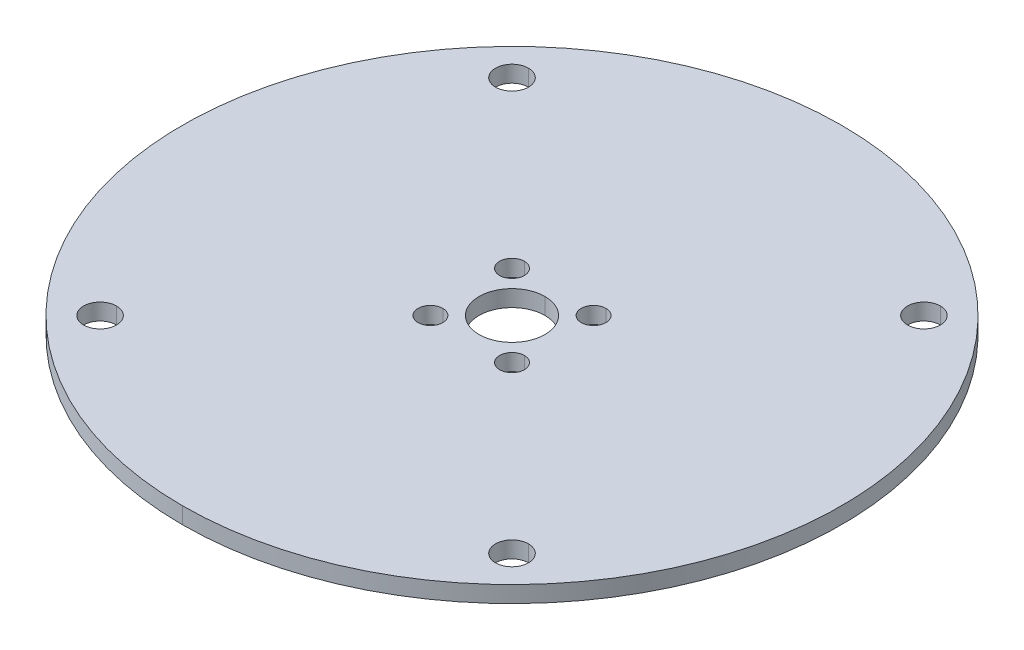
ISO-10303-21;
HEADER;
FILE_DESCRIPTION(('STEP AP214'),'2;1');
FILE_NAME('part.step','',(''),(''),'','','');
FILE_SCHEMA(('AUTOMOTIVE_DESIGN { 1 0 10303 214 1 1 1 1 }'));
ENDSEC;
DATA;
#1=APPLICATION_CONTEXT('core data for automotive mechanical design processes');
#2=APPLICATION_PROTOCOL_DEFINITION('international standard','automotive_design',2000,#1);
#3=PRODUCT_CONTEXT('',#1,'mechanical');
#4=PRODUCT('Part','Part','',(#3));
#5=PRODUCT_RELATED_PRODUCT_CATEGORY('part','',(#4));
#6=PRODUCT_DEFINITION_FORMATION('','',#4);
#7=PRODUCT_DEFINITION_CONTEXT('part definition',#1,'design');
#8=PRODUCT_DEFINITION('design','',#6,#7);
#9=PRODUCT_DEFINITION_SHAPE('','',#8);
#10=(LENGTH_UNIT() NAMED_UNIT(*) SI_UNIT(.MILLI.,.METRE.));
#11=(NAMED_UNIT(*) PLANE_ANGLE_UNIT() SI_UNIT($,.RADIAN.));
#12=(NAMED_UNIT(*) SI_UNIT($,.STERADIAN.) SOLID_ANGLE_UNIT());
#13=UNCERTAINTY_MEASURE_WITH_UNIT(LENGTH_MEASURE(1.E-05),#10,'distance_accuracy_value','');
#14=(GEOMETRIC_REPRESENTATION_CONTEXT(3) GLOBAL_UNCERTAINTY_ASSIGNED_CONTEXT((#13)) GLOBAL_UNIT_ASSIGNED_CONTEXT((#10,
#11,#12)) REPRESENTATION_CONTEXT('',''));
#15=CARTESIAN_POINT('',(0.,0.,0.));
#16=DIRECTION('',(0.,0.,1.));
#17=DIRECTION('',(1.,0.,0.));
#18=AXIS2_PLACEMENT_3D('',#15,#16,#17);
#19=CARTESIAN_POINT('',(273.9989878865,-2.,-129.7363133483));
#20=DIRECTION('',(0.,1.,0.));
#21=DIRECTION('',(0.,0.,1.));
#22=AXIS2_PLACEMENT_3D('',#19,#20,#21);
#23=CYLINDRICAL_SURFACE('',#22,2.);
#24=DIRECTION('',(0.,-1.,0.));
#25=VECTOR('',#24,1.);
#26=CARTESIAN_POINT('',(273.9989878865,0.,-131.7363133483));
#27=LINE('',#26,#25);
#28=CARTESIAN_POINT('',(273.9989878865,0.,-131.7363133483));
#29=VERTEX_POINT('',#28);
#30=CARTESIAN_POINT('',(273.9989878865,-2.,-131.7363133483));
#31=VERTEX_POINT('',#30);
#32=EDGE_CURVE('E11',#29,#31,#27,.T.);
#33=ORIENTED_EDGE('',*,*,#32,.F.);
#34=CARTESIAN_POINT('',(273.9989878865,0.,-129.7363133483));
#35=DIRECTION('',(0.,-1.,0.));
#36=DIRECTION('',(0.,0.,1.));
#37=AXIS2_PLACEMENT_3D('',#34,#35,#36);
#38=CIRCLE('',#37,2.);
#39=CARTESIAN_POINT('',(273.9989878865,0.,-127.7363133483));
#40=VERTEX_POINT('',#39);
#41=EDGE_CURVE('E228',#40,#29,#38,.T.);
#42=ORIENTED_EDGE('',*,*,#41,.F.);
#43=DIRECTION('',(0.,-1.,0.));
#44=VECTOR('',#43,1.);
#45=CARTESIAN_POINT('',(273.9989878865,0.,-127.7363133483));
#46=LINE('',#45,#44);
#47=CARTESIAN_POINT('',(273.9989878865,-2.,-127.7363133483));
#48=VERTEX_POINT('',#47);
#49=EDGE_CURVE('E28',#40,#48,#46,.T.);
#50=ORIENTED_EDGE('',*,*,#49,.T.);
#51=CARTESIAN_POINT('',(273.9989878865,-2.,-129.7363133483));
#52=DIRECTION('',(0.,1.,0.));
#53=DIRECTION('',(0.,0.,-1.));
#54=AXIS2_PLACEMENT_3D('',#51,#52,#53);
#55=CIRCLE('',#54,2.);
#56=EDGE_CURVE('E216',#31,#48,#55,.T.);
#57=ORIENTED_EDGE('',*,*,#56,.F.);
#58=EDGE_LOOP('',(#33,#42,#50,#57));
#59=FACE_BOUND('',#58,.T.);
#60=ADVANCED_FACE('F17',(#59),#23,.F.);
#61=CARTESIAN_POINT('',(273.9989878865,-2.,-129.7363133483));
#62=DIRECTION('',(0.,1.,0.));
#63=DIRECTION('',(0.,0.,1.));
#64=AXIS2_PLACEMENT_3D('',#61,#62,#63);
#65=CYLINDRICAL_SURFACE('',#64,2.);
#66=CARTESIAN_POINT('',(273.9989878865,-2.,-129.7363133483));
#67=DIRECTION('',(0.,1.,0.));
#68=DIRECTION('',(0.,0.,1.));
#69=AXIS2_PLACEMENT_3D('',#66,#67,#68);
#70=CIRCLE('',#69,2.);
#71=EDGE_CURVE('E209',#48,#31,#70,.T.);
#72=ORIENTED_EDGE('',*,*,#71,.F.);
#73=ORIENTED_EDGE('',*,*,#49,.F.);
#74=CARTESIAN_POINT('',(273.9989878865,0.,-129.7363133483));
#75=DIRECTION('',(0.,-1.,0.));
#76=DIRECTION('',(0.,0.,-1.));
#77=AXIS2_PLACEMENT_3D('',#74,#75,#76);
#78=CIRCLE('',#77,2.);
#79=EDGE_CURVE('E283',#29,#40,#78,.T.);
#80=ORIENTED_EDGE('',*,*,#79,.F.);
#81=ORIENTED_EDGE('',*,*,#32,.T.);
#82=EDGE_LOOP('',(#72,#73,#80,#81));
#83=FACE_BOUND('',#82,.T.);
#84=ADVANCED_FACE('F485',(#83),#65,.F.);
#85=CARTESIAN_POINT('',(273.9989878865,-2.,-179.7363133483));
#86=DIRECTION('',(0.,1.,0.));
#87=DIRECTION('',(0.,0.,1.));
#88=AXIS2_PLACEMENT_3D('',#85,#86,#87);
#89=CYLINDRICAL_SURFACE('',#88,2.);
#90=DIRECTION('',(0.,-1.,0.));
#91=VECTOR('',#90,1.);
#92=CARTESIAN_POINT('',(273.9989878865,0.,-181.7363133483));
#93=LINE('',#92,#91);
#94=CARTESIAN_POINT('',(273.9989878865,0.,-181.7363133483));
#95=VERTEX_POINT('',#94);
#96=CARTESIAN_POINT('',(273.9989878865,-2.,-181.7363133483));
#97=VERTEX_POINT('',#96);
#98=EDGE_CURVE('E229',#95,#97,#93,.T.);
#99=ORIENTED_EDGE('',*,*,#98,.F.);
#100=CARTESIAN_POINT('',(273.9989878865,0.,-179.7363133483));
#101=DIRECTION('',(0.,-1.,0.));
#102=DIRECTION('',(0.,0.,1.));
#103=AXIS2_PLACEMENT_3D('',#100,#101,#102);
#104=CIRCLE('',#103,2.);
#105=CARTESIAN_POINT('',(273.9989878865,0.,-177.7363133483));
#106=VERTEX_POINT('',#105);
#107=EDGE_CURVE('E220',#106,#95,#104,.T.);
#108=ORIENTED_EDGE('',*,*,#107,.F.);
#109=DIRECTION('',(0.,-1.,0.));
#110=VECTOR('',#109,1.);
#111=CARTESIAN_POINT('',(273.9989878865,0.,-177.7363133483));
#112=LINE('',#111,#110);
#113=CARTESIAN_POINT('',(273.9989878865,-2.,-177.7363133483));
#114=VERTEX_POINT('',#113);
#115=EDGE_CURVE('E21',#106,#114,#112,.T.);
#116=ORIENTED_EDGE('',*,*,#115,.T.);
#117=CARTESIAN_POINT('',(273.9989878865,-2.,-179.7363133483));
#118=DIRECTION('',(0.,1.,0.));
#119=DIRECTION('',(0.,0.,-1.));
#120=AXIS2_PLACEMENT_3D('',#117,#118,#119);
#121=CIRCLE('',#120,2.);
#122=EDGE_CURVE('E340',#97,#114,#121,.T.);
#123=ORIENTED_EDGE('',*,*,#122,.F.);
#124=EDGE_LOOP('',(#99,#108,#116,#123));
#125=FACE_BOUND('',#124,.T.);
#126=ADVANCED_FACE('F490',(#125),#89,.F.);
#127=CARTESIAN_POINT('',(273.9989878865,-2.,-179.7363133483));
#128=DIRECTION('',(0.,1.,0.));
#129=DIRECTION('',(0.,0.,1.));
#130=AXIS2_PLACEMENT_3D('',#127,#128,#129);
#131=CYLINDRICAL_SURFACE('',#130,2.);
#132=CARTESIAN_POINT('',(273.9989878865,-2.,-179.7363133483));
#133=DIRECTION('',(0.,1.,0.));
#134=DIRECTION('',(0.,0.,1.));
#135=AXIS2_PLACEMENT_3D('',#132,#133,#134);
#136=CIRCLE('',#135,2.);
#137=EDGE_CURVE('E263',#114,#97,#136,.T.);
#138=ORIENTED_EDGE('',*,*,#137,.F.);
#139=ORIENTED_EDGE('',*,*,#115,.F.);
#140=CARTESIAN_POINT('',(273.9989878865,0.,-179.7363133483));
#141=DIRECTION('',(0.,-1.,0.));
#142=DIRECTION('',(0.,0.,-1.));
#143=AXIS2_PLACEMENT_3D('',#140,#141,#142);
#144=CIRCLE('',#143,2.);
#145=EDGE_CURVE('E223',#95,#106,#144,.T.);
#146=ORIENTED_EDGE('',*,*,#145,.F.);
#147=ORIENTED_EDGE('',*,*,#98,.T.);
#148=EDGE_LOOP('',(#138,#139,#146,#147));
#149=FACE_BOUND('',#148,.T.);
#150=ADVANCED_FACE('F502',(#149),#131,.F.);
#151=CARTESIAN_POINT('',(223.9989878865,-2.,-179.7363133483));
#152=DIRECTION('',(0.,1.,0.));
#153=DIRECTION('',(0.,0.,1.));
#154=AXIS2_PLACEMENT_3D('',#151,#152,#153);
#155=CYLINDRICAL_SURFACE('',#154,2.);
#156=DIRECTION('',(0.,-1.,0.));
#157=VECTOR('',#156,1.);
#158=CARTESIAN_POINT('',(223.9989878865,0.,-181.7363133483));
#159=LINE('',#158,#157);
#160=CARTESIAN_POINT('',(223.9989878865,0.,-181.7363133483));
#161=VERTEX_POINT('',#160);
#162=CARTESIAN_POINT('',(223.9989878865,-2.,-181.7363133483));
#163=VERTEX_POINT('',#162);
#164=EDGE_CURVE('E376',#161,#163,#159,.T.);
#165=ORIENTED_EDGE('',*,*,#164,.F.);
#166=CARTESIAN_POINT('',(223.9989878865,0.,-179.7363133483));
#167=DIRECTION('',(0.,-1.,0.));
#168=DIRECTION('',(0.,0.,1.));
#169=AXIS2_PLACEMENT_3D('',#166,#167,#168);
#170=CIRCLE('',#169,2.);
#171=CARTESIAN_POINT('',(223.9989878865,0.,-177.7363133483));
#172=VERTEX_POINT('',#171);
#173=EDGE_CURVE('E360',#172,#161,#170,.T.);
#174=ORIENTED_EDGE('',*,*,#173,.F.);
#175=DIRECTION('',(0.,-1.,0.));
#176=VECTOR('',#175,1.);
#177=CARTESIAN_POINT('',(223.9989878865,0.,-177.7363133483));
#178=LINE('',#177,#176);
#179=CARTESIAN_POINT('',(223.9989878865,-2.,-177.7363133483));
#180=VERTEX_POINT('',#179);
#181=EDGE_CURVE('E380',#172,#180,#178,.T.);
#182=ORIENTED_EDGE('',*,*,#181,.T.);
#183=CARTESIAN_POINT('',(223.9989878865,-2.,-179.7363133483));
#184=DIRECTION('',(0.,1.,0.));
#185=DIRECTION('',(0.,0.,-1.));
#186=AXIS2_PLACEMENT_3D('',#183,#184,#185);
#187=CIRCLE('',#186,2.);
#188=EDGE_CURVE('E233',#163,#180,#187,.T.);
#189=ORIENTED_EDGE('',*,*,#188,.F.);
#190=EDGE_LOOP('',(#165,#174,#182,#189));
#191=FACE_BOUND('',#190,.T.);
#192=ADVANCED_FACE('F457',(#191),#155,.F.);
#193=CARTESIAN_POINT('',(223.9989878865,-2.,-179.7363133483));
#194=DIRECTION('',(0.,1.,0.));
#195=DIRECTION('',(0.,0.,1.));
#196=AXIS2_PLACEMENT_3D('',#193,#194,#195);
#197=CYLINDRICAL_SURFACE('',#196,2.);
#198=CARTESIAN_POINT('',(223.9989878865,-2.,-179.7363133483));
#199=DIRECTION('',(0.,1.,0.));
#200=DIRECTION('',(0.,0.,1.));
#201=AXIS2_PLACEMENT_3D('',#198,#199,#200);
#202=CIRCLE('',#201,2.);
#203=EDGE_CURVE('E237',#180,#163,#202,.T.);
#204=ORIENTED_EDGE('',*,*,#203,.F.);
#205=ORIENTED_EDGE('',*,*,#181,.F.);
#206=CARTESIAN_POINT('',(223.9989878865,0.,-179.7363133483));
#207=DIRECTION('',(0.,-1.,0.));
#208=DIRECTION('',(0.,0.,-1.));
#209=AXIS2_PLACEMENT_3D('',#206,#207,#208);
#210=CIRCLE('',#209,2.);
#211=EDGE_CURVE('E224',#161,#172,#210,.T.);
#212=ORIENTED_EDGE('',*,*,#211,.F.);
#213=ORIENTED_EDGE('',*,*,#164,.T.);
#214=EDGE_LOOP('',(#204,#205,#212,#213));
#215=FACE_BOUND('',#214,.T.);
#216=ADVANCED_FACE('F451',(#215),#197,.F.);
#217=CARTESIAN_POINT('',(248.9989878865,-2.,-154.7363133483));
#218=DIRECTION('',(0.,1.,0.));
#219=DIRECTION('',(0.,0.,1.));
#220=AXIS2_PLACEMENT_3D('',#217,#218,#219);
#221=CYLINDRICAL_SURFACE('',#220,4.);
#222=DIRECTION('',(0.,-1.,0.));
#223=VECTOR('',#222,1.);
#224=CARTESIAN_POINT('',(248.9989878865,0.,-158.7363133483));
#225=LINE('',#224,#223);
#226=CARTESIAN_POINT('',(248.9989878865,0.,-158.7363133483));
#227=VERTEX_POINT('',#226);
#228=CARTESIAN_POINT('',(248.9989878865,-2.,-158.7363133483));
#229=VERTEX_POINT('',#228);
#230=EDGE_CURVE('E242',#227,#229,#225,.T.);
#231=ORIENTED_EDGE('',*,*,#230,.F.);
#232=CARTESIAN_POINT('',(248.9989878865,0.,-154.7363133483));
#233=DIRECTION('',(0.,-1.,0.));
#234=DIRECTION('',(0.,0.,1.));
#235=AXIS2_PLACEMENT_3D('',#232,#233,#234);
#236=CIRCLE('',#235,4.);
#237=CARTESIAN_POINT('',(248.9989878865,0.,-150.7363133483));
#238=VERTEX_POINT('',#237);
#239=EDGE_CURVE('E296',#238,#227,#236,.T.);
#240=ORIENTED_EDGE('',*,*,#239,.F.);
#241=DIRECTION('',(0.,-1.,0.));
#242=VECTOR('',#241,1.);
#243=CARTESIAN_POINT('',(248.9989878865,0.,-150.7363133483));
#244=LINE('',#243,#242);
#245=CARTESIAN_POINT('',(248.9989878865,-2.,-150.7363133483));
#246=VERTEX_POINT('',#245);
#247=EDGE_CURVE('E239',#238,#246,#244,.T.);
#248=ORIENTED_EDGE('',*,*,#247,.T.);
#249=CARTESIAN_POINT('',(248.9989878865,-2.,-154.7363133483));
#250=DIRECTION('',(0.,1.,0.));
#251=DIRECTION('',(0.,0.,-1.));
#252=AXIS2_PLACEMENT_3D('',#249,#250,#251);
#253=CIRCLE('',#252,4.);
#254=EDGE_CURVE('E248',#229,#246,#253,.T.);
#255=ORIENTED_EDGE('',*,*,#254,.F.);
#256=EDGE_LOOP('',(#231,#240,#248,#255));
#257=FACE_BOUND('',#256,.T.);
#258=ADVANCED_FACE('F509',(#257),#221,.F.);
#259=CARTESIAN_POINT('',(248.9989878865,-2.,-154.7363133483));
#260=DIRECTION('',(0.,1.,0.));
#261=DIRECTION('',(0.,0.,1.));
#262=AXIS2_PLACEMENT_3D('',#259,#260,#261);
#263=CYLINDRICAL_SURFACE('',#262,4.);
#264=CARTESIAN_POINT('',(248.9989878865,-2.,-154.7363133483));
#265=DIRECTION('',(0.,1.,0.));
#266=DIRECTION('',(0.,0.,1.));
#267=AXIS2_PLACEMENT_3D('',#264,#265,#266);
#268=CIRCLE('',#267,4.);
#269=EDGE_CURVE('E238',#246,#229,#268,.T.);
#270=ORIENTED_EDGE('',*,*,#269,.F.);
#271=ORIENTED_EDGE('',*,*,#247,.F.);
#272=CARTESIAN_POINT('',(248.9989878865,0.,-154.7363133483));
#273=DIRECTION('',(0.,-1.,0.));
#274=DIRECTION('',(0.,0.,-1.));
#275=AXIS2_PLACEMENT_3D('',#272,#273,#274);
#276=CIRCLE('',#275,4.);
#277=EDGE_CURVE('E299',#227,#238,#276,.T.);
#278=ORIENTED_EDGE('',*,*,#277,.F.);
#279=ORIENTED_EDGE('',*,*,#230,.T.);
#280=EDGE_LOOP('',(#270,#271,#278,#279));
#281=FACE_BOUND('',#280,.T.);
#282=ADVANCED_FACE('F520',(#281),#263,.F.);
#283=CARTESIAN_POINT('',(244.0492404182,-2.,-159.6860608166));
#284=DIRECTION('',(0.,1.,0.));
#285=DIRECTION('',(0.,0.,1.));
#286=AXIS2_PLACEMENT_3D('',#283,#284,#285);
#287=CYLINDRICAL_SURFACE('',#286,1.5);
#288=DIRECTION('',(0.,-1.,0.));
#289=VECTOR('',#288,1.);
#290=CARTESIAN_POINT('',(244.0492404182,0.,-161.1860608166));
#291=LINE('',#290,#289);
#292=CARTESIAN_POINT('',(244.0492404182,0.,-161.1860608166));
#293=VERTEX_POINT('',#292);
#294=CARTESIAN_POINT('',(244.0492404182,-2.,-161.1860608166));
#295=VERTEX_POINT('',#294);
#296=EDGE_CURVE('E243',#293,#295,#291,.T.);
#297=ORIENTED_EDGE('',*,*,#296,.F.);
#298=CARTESIAN_POINT('',(244.0492404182,0.,-159.6860608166));
#299=DIRECTION('',(0.,-1.,0.));
#300=DIRECTION('',(0.,0.,1.));
#301=AXIS2_PLACEMENT_3D('',#298,#299,#300);
#302=CIRCLE('',#301,1.5);
#303=CARTESIAN_POINT('',(244.0492404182,0.,-158.1860608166));
#304=VERTEX_POINT('',#303);
#305=EDGE_CURVE('E344',#304,#293,#302,.T.);
#306=ORIENTED_EDGE('',*,*,#305,.F.);
#307=DIRECTION('',(0.,-1.,0.));
#308=VECTOR('',#307,1.);
#309=CARTESIAN_POINT('',(244.0492404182,0.,-158.1860608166));
#310=LINE('',#309,#308);
#311=CARTESIAN_POINT('',(244.0492404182,-2.,-158.1860608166));
#312=VERTEX_POINT('',#311);
#313=EDGE_CURVE('E290',#304,#312,#310,.T.);
#314=ORIENTED_EDGE('',*,*,#313,.T.);
#315=CARTESIAN_POINT('',(244.0492404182,-2.,-159.6860608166));
#316=DIRECTION('',(0.,1.,0.));
#317=DIRECTION('',(0.,0.,-1.));
#318=AXIS2_PLACEMENT_3D('',#315,#316,#317);
#319=CIRCLE('',#318,1.5);
#320=EDGE_CURVE('E249',#295,#312,#319,.T.);
#321=ORIENTED_EDGE('',*,*,#320,.F.);
#322=EDGE_LOOP('',(#297,#306,#314,#321));
#323=FACE_BOUND('',#322,.T.);
#324=ADVANCED_FACE('F517',(#323),#287,.F.);
#325=CARTESIAN_POINT('',(244.0492404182,-2.,-159.6860608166));
#326=DIRECTION('',(0.,1.,0.));
#327=DIRECTION('',(0.,0.,1.));
#328=AXIS2_PLACEMENT_3D('',#325,#326,#327);
#329=CYLINDRICAL_SURFACE('',#328,1.5);
#330=CARTESIAN_POINT('',(244.0492404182,-2.,-159.6860608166));
#331=DIRECTION('',(0.,1.,0.));
#332=DIRECTION('',(0.,0.,1.));
#333=AXIS2_PLACEMENT_3D('',#330,#331,#332);
#334=CIRCLE('',#333,1.5);
#335=EDGE_CURVE('E244',#312,#295,#334,.T.);
#336=ORIENTED_EDGE('',*,*,#335,.F.);
#337=ORIENTED_EDGE('',*,*,#313,.F.);
#338=CARTESIAN_POINT('',(244.0492404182,0.,-159.6860608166));
#339=DIRECTION('',(0.,-1.,0.));
#340=DIRECTION('',(0.,0.,-1.));
#341=AXIS2_PLACEMENT_3D('',#338,#339,#340);
#342=CIRCLE('',#341,1.5);
#343=EDGE_CURVE('E300',#293,#304,#342,.T.);
#344=ORIENTED_EDGE('',*,*,#343,.F.);
#345=ORIENTED_EDGE('',*,*,#296,.T.);
#346=EDGE_LOOP('',(#336,#337,#344,#345));
#347=FACE_BOUND('',#346,.T.);
#348=ADVANCED_FACE('F499',(#347),#329,.F.);
#349=CARTESIAN_POINT('',(244.0492404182,-2.,-149.78656588));
#350=DIRECTION('',(0.,1.,0.));
#351=DIRECTION('',(0.,0.,1.));
#352=AXIS2_PLACEMENT_3D('',#349,#350,#351);
#353=CYLINDRICAL_SURFACE('',#352,1.5);
#354=DIRECTION('',(0.,-1.,0.));
#355=VECTOR('',#354,1.);
#356=CARTESIAN_POINT('',(244.0492404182,0.,-151.28656588));
#357=LINE('',#356,#355);
#358=CARTESIAN_POINT('',(244.0492404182,0.,-151.28656588));
#359=VERTEX_POINT('',#358);
#360=CARTESIAN_POINT('',(244.0492404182,-2.,-151.28656588));
#361=VERTEX_POINT('',#360);
#362=EDGE_CURVE('E154',#359,#361,#357,.T.);
#363=ORIENTED_EDGE('',*,*,#362,.F.);
#364=CARTESIAN_POINT('',(244.0492404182,0.,-149.78656588));
#365=DIRECTION('',(0.,-1.,0.));
#366=DIRECTION('',(0.,0.,1.));
#367=AXIS2_PLACEMENT_3D('',#364,#365,#366);
#368=CIRCLE('',#367,1.5);
#369=CARTESIAN_POINT('',(244.0492404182,0.,-148.28656588));
#370=VERTEX_POINT('',#369);
#371=EDGE_CURVE('E278',#370,#359,#368,.T.);
#372=ORIENTED_EDGE('',*,*,#371,.F.);
#373=DIRECTION('',(0.,-1.,0.));
#374=VECTOR('',#373,1.);
#375=CARTESIAN_POINT('',(244.0492404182,0.,-148.28656588));
#376=LINE('',#375,#374);
#377=CARTESIAN_POINT('',(244.0492404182,-2.,-148.28656588));
#378=VERTEX_POINT('',#377);
#379=EDGE_CURVE('E166',#370,#378,#376,.T.);
#380=ORIENTED_EDGE('',*,*,#379,.T.);
#381=CARTESIAN_POINT('',(244.0492404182,-2.,-149.78656588));
#382=DIRECTION('',(0.,1.,0.));
#383=DIRECTION('',(0.,0.,-1.));
#384=AXIS2_PLACEMENT_3D('',#381,#382,#383);
#385=CIRCLE('',#384,1.5);
#386=EDGE_CURVE('E267',#361,#378,#385,.T.);
#387=ORIENTED_EDGE('',*,*,#386,.F.);
#388=EDGE_LOOP('',(#363,#372,#380,#387));
#389=FACE_BOUND('',#388,.T.);
#390=ADVANCED_FACE('F495',(#389),#353,.F.);
#391=CARTESIAN_POINT('',(244.0492404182,-2.,-149.78656588));
#392=DIRECTION('',(0.,1.,0.));
#393=DIRECTION('',(0.,0.,1.));
#394=AXIS2_PLACEMENT_3D('',#391,#392,#393);
#395=CYLINDRICAL_SURFACE('',#394,1.5);
#396=CARTESIAN_POINT('',(244.0492404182,-2.,-149.78656588));
#397=DIRECTION('',(0.,1.,0.));
#398=DIRECTION('',(0.,0.,1.));
#399=AXIS2_PLACEMENT_3D('',#396,#397,#398);
#400=CIRCLE('',#399,1.5);
#401=EDGE_CURVE('E253',#378,#361,#400,.T.);
#402=ORIENTED_EDGE('',*,*,#401,.F.);
#403=ORIENTED_EDGE('',*,*,#379,.F.);
#404=CARTESIAN_POINT('',(244.0492404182,0.,-149.78656588));
#405=DIRECTION('',(0.,-1.,0.));
#406=DIRECTION('',(0.,0.,-1.));
#407=AXIS2_PLACEMENT_3D('',#404,#405,#406);
#408=CIRCLE('',#407,1.5);
#409=EDGE_CURVE('E282',#359,#370,#408,.T.);
#410=ORIENTED_EDGE('',*,*,#409,.F.);
#411=ORIENTED_EDGE('',*,*,#362,.T.);
#412=EDGE_LOOP('',(#402,#403,#410,#411));
#413=FACE_BOUND('',#412,.T.);
#414=ADVANCED_FACE('F498',(#413),#395,.F.);
#415=CARTESIAN_POINT('',(253.9487353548,-2.,-149.78656588));
#416=DIRECTION('',(0.,1.,0.));
#417=DIRECTION('',(0.,0.,1.));
#418=AXIS2_PLACEMENT_3D('',#415,#416,#417);
#419=CYLINDRICAL_SURFACE('',#418,1.5);
#420=DIRECTION('',(0.,-1.,0.));
#421=VECTOR('',#420,1.);
#422=CARTESIAN_POINT('',(253.9487353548,0.,-151.28656588));
#423=LINE('',#422,#421);
#424=CARTESIAN_POINT('',(253.9487353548,0.,-151.28656588));
#425=VERTEX_POINT('',#424);
#426=CARTESIAN_POINT('',(253.9487353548,-2.,-151.28656588));
#427=VERTEX_POINT('',#426);
#428=EDGE_CURVE('E350',#425,#427,#423,.T.);
#429=ORIENTED_EDGE('',*,*,#428,.F.);
#430=CARTESIAN_POINT('',(253.9487353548,0.,-149.78656588));
#431=DIRECTION('',(0.,-1.,0.));
#432=DIRECTION('',(0.,0.,1.));
#433=AXIS2_PLACEMENT_3D('',#430,#431,#432);
#434=CIRCLE('',#433,1.5);
#435=CARTESIAN_POINT('',(253.9487353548,0.,-148.28656588));
#436=VERTEX_POINT('',#435);
#437=EDGE_CURVE('E272',#436,#425,#434,.T.);
#438=ORIENTED_EDGE('',*,*,#437,.F.);
#439=DIRECTION('',(0.,-1.,0.));
#440=VECTOR('',#439,1.);
#441=CARTESIAN_POINT('',(253.9487353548,0.,-148.28656588));
#442=LINE('',#441,#440);
#443=CARTESIAN_POINT('',(253.9487353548,-2.,-148.28656588));
#444=VERTEX_POINT('',#443);
#445=EDGE_CURVE('E353',#436,#444,#442,.T.);
#446=ORIENTED_EDGE('',*,*,#445,.T.);
#447=CARTESIAN_POINT('',(253.9487353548,-2.,-149.78656588));
#448=DIRECTION('',(0.,1.,0.));
#449=DIRECTION('',(0.,0.,-1.));
#450=AXIS2_PLACEMENT_3D('',#447,#448,#449);
#451=CIRCLE('',#450,1.5);
#452=EDGE_CURVE('E254',#427,#444,#451,.T.);
#453=ORIENTED_EDGE('',*,*,#452,.F.);
#454=EDGE_LOOP('',(#429,#438,#446,#453));
#455=FACE_BOUND('',#454,.T.);
#456=ADVANCED_FACE('F19',(#455),#419,.F.);
#457=CARTESIAN_POINT('',(253.9487353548,-2.,-149.78656588));
#458=DIRECTION('',(0.,1.,0.));
#459=DIRECTION('',(0.,0.,1.));
#460=AXIS2_PLACEMENT_3D('',#457,#458,#459);
#461=CYLINDRICAL_SURFACE('',#460,1.5);
#462=CARTESIAN_POINT('',(253.9487353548,-2.,-149.78656588));
#463=DIRECTION('',(0.,1.,0.));
#464=DIRECTION('',(0.,0.,1.));
#465=AXIS2_PLACEMENT_3D('',#462,#463,#464);
#466=CIRCLE('',#465,1.5);
#467=EDGE_CURVE('E258',#444,#427,#466,.T.);
#468=ORIENTED_EDGE('',*,*,#467,.F.);
#469=ORIENTED_EDGE('',*,*,#445,.F.);
#470=CARTESIAN_POINT('',(253.9487353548,0.,-149.78656588));
#471=DIRECTION('',(0.,-1.,0.));
#472=DIRECTION('',(0.,0.,-1.));
#473=AXIS2_PLACEMENT_3D('',#470,#471,#472);
#474=CIRCLE('',#473,1.5);
#475=EDGE_CURVE('E276',#425,#436,#474,.T.);
#476=ORIENTED_EDGE('',*,*,#475,.F.);
#477=ORIENTED_EDGE('',*,*,#428,.T.);
#478=EDGE_LOOP('',(#468,#469,#476,#477));
#479=FACE_BOUND('',#478,.T.);
#480=ADVANCED_FACE('F481',(#479),#461,.F.);
#481=CARTESIAN_POINT('',(253.9487353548,-2.,-159.6860608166));
#482=DIRECTION('',(0.,1.,0.));
#483=DIRECTION('',(0.,0.,1.));
#484=AXIS2_PLACEMENT_3D('',#481,#482,#483);
#485=CYLINDRICAL_SURFACE('',#484,1.5);
#486=DIRECTION('',(0.,-1.,0.));
#487=VECTOR('',#486,1.);
#488=CARTESIAN_POINT('',(253.9487353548,0.,-161.1860608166));
#489=LINE('',#488,#487);
#490=CARTESIAN_POINT('',(253.9487353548,0.,-161.1860608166));
#491=VERTEX_POINT('',#490);
#492=CARTESIAN_POINT('',(253.9487353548,-2.,-161.1860608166));
#493=VERTEX_POINT('',#492);
#494=EDGE_CURVE('E366',#491,#493,#489,.T.);
#495=ORIENTED_EDGE('',*,*,#494,.F.);
#496=CARTESIAN_POINT('',(253.9487353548,0.,-159.6860608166));
#497=DIRECTION('',(0.,-1.,0.));
#498=DIRECTION('',(0.,0.,1.));
#499=AXIS2_PLACEMENT_3D('',#496,#497,#498);
#500=CIRCLE('',#499,1.5);
#501=CARTESIAN_POINT('',(253.9487353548,0.,-158.1860608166));
#502=VERTEX_POINT('',#501);
#503=EDGE_CURVE('E197',#502,#491,#500,.T.);
#504=ORIENTED_EDGE('',*,*,#503,.F.);
#505=DIRECTION('',(0.,-1.,0.));
#506=VECTOR('',#505,1.);
#507=CARTESIAN_POINT('',(253.9487353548,0.,-158.1860608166));
#508=LINE('',#507,#506);
#509=CARTESIAN_POINT('',(253.9487353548,-2.,-158.1860608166));
#510=VERTEX_POINT('',#509);
#511=EDGE_CURVE('E287',#502,#510,#508,.T.);
#512=ORIENTED_EDGE('',*,*,#511,.T.);
#513=CARTESIAN_POINT('',(253.9487353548,-2.,-159.6860608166));
#514=DIRECTION('',(0.,1.,0.));
#515=DIRECTION('',(0.,0.,-1.));
#516=AXIS2_PLACEMENT_3D('',#513,#514,#515);
#517=CIRCLE('',#516,1.5);
#518=EDGE_CURVE('E336',#493,#510,#517,.T.);
#519=ORIENTED_EDGE('',*,*,#518,.F.);
#520=EDGE_LOOP('',(#495,#504,#512,#519));
#521=FACE_BOUND('',#520,.T.);
#522=ADVANCED_FACE('F475',(#521),#485,.F.);
#523=CARTESIAN_POINT('',(253.9487353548,-2.,-159.6860608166));
#524=DIRECTION('',(0.,1.,0.));
#525=DIRECTION('',(0.,0.,1.));
#526=AXIS2_PLACEMENT_3D('',#523,#524,#525);
#527=CYLINDRICAL_SURFACE('',#526,1.5);
#528=CARTESIAN_POINT('',(253.9487353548,-2.,-159.6860608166));
#529=DIRECTION('',(0.,1.,0.));
#530=DIRECTION('',(0.,0.,1.));
#531=AXIS2_PLACEMENT_3D('',#528,#529,#530);
#532=CIRCLE('',#531,1.5);
#533=EDGE_CURVE('E259',#510,#493,#532,.T.);
#534=ORIENTED_EDGE('',*,*,#533,.F.);
#535=ORIENTED_EDGE('',*,*,#511,.F.);
#536=CARTESIAN_POINT('',(253.9487353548,0.,-159.6860608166));
#537=DIRECTION('',(0.,-1.,0.));
#538=DIRECTION('',(0.,0.,-1.));
#539=AXIS2_PLACEMENT_3D('',#536,#537,#538);
#540=CIRCLE('',#539,1.5);
#541=EDGE_CURVE('E277',#491,#502,#540,.T.);
#542=ORIENTED_EDGE('',*,*,#541,.F.);
#543=ORIENTED_EDGE('',*,*,#494,.T.);
#544=EDGE_LOOP('',(#534,#535,#542,#543));
#545=FACE_BOUND('',#544,.T.);
#546=ADVANCED_FACE('F463',(#545),#527,.F.);
#547=CARTESIAN_POINT('',(248.9989878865,0.,-154.7363133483));
#548=DIRECTION('',(0.,1.,0.));
#549=DIRECTION('',(1.,0.,0.));
#550=AXIS2_PLACEMENT_3D('',#547,#548,#549);
#551=PLANE('',#550);
#552=ORIENTED_EDGE('',*,*,#41,.T.);
#553=ORIENTED_EDGE('',*,*,#79,.T.);
#554=EDGE_LOOP('',(#552,#553));
#555=FACE_BOUND('',#554,.T.);
#556=ORIENTED_EDGE('',*,*,#107,.T.);
#557=ORIENTED_EDGE('',*,*,#145,.T.);
#558=EDGE_LOOP('',(#556,#557));
#559=FACE_BOUND('',#558,.T.);
#560=ORIENTED_EDGE('',*,*,#173,.T.);
#561=ORIENTED_EDGE('',*,*,#211,.T.);
#562=EDGE_LOOP('',(#560,#561));
#563=FACE_BOUND('',#562,.T.);
#564=CARTESIAN_POINT('',(223.9989878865,0.,-129.7363133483));
#565=DIRECTION('',(0.,-1.,0.));
#566=DIRECTION('',(0.,0.,1.));
#567=AXIS2_PLACEMENT_3D('',#564,#565,#566);
#568=CIRCLE('',#567,2.);
#569=CARTESIAN_POINT('',(223.9989878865,0.,-127.7363133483));
#570=VERTEX_POINT('',#569);
#571=CARTESIAN_POINT('',(223.9989878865,0.,-131.7363133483));
#572=VERTEX_POINT('',#571);
#573=EDGE_CURVE('E301',#570,#572,#568,.T.);
#574=ORIENTED_EDGE('',*,*,#573,.T.);
#575=CARTESIAN_POINT('',(223.9989878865,0.,-129.7363133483));
#576=DIRECTION('',(0.,-1.,0.));
#577=DIRECTION('',(0.,0.,-1.));
#578=AXIS2_PLACEMENT_3D('',#575,#576,#577);
#579=CIRCLE('',#578,2.);
#580=EDGE_CURVE('E314',#572,#570,#579,.T.);
#581=ORIENTED_EDGE('',*,*,#580,.T.);
#582=EDGE_LOOP('',(#574,#581));
#583=FACE_BOUND('',#582,.T.);
#584=ORIENTED_EDGE('',*,*,#239,.T.);
#585=ORIENTED_EDGE('',*,*,#277,.T.);
#586=EDGE_LOOP('',(#584,#585));
#587=FACE_BOUND('',#586,.T.);
#588=ORIENTED_EDGE('',*,*,#305,.T.);
#589=ORIENTED_EDGE('',*,*,#343,.T.);
#590=EDGE_LOOP('',(#588,#589));
#591=FACE_BOUND('',#590,.T.);
#592=ORIENTED_EDGE('',*,*,#371,.T.);
#593=ORIENTED_EDGE('',*,*,#409,.T.);
#594=EDGE_LOOP('',(#592,#593));
#595=FACE_BOUND('',#594,.T.);
#596=ORIENTED_EDGE('',*,*,#437,.T.);
#597=ORIENTED_EDGE('',*,*,#475,.T.);
#598=EDGE_LOOP('',(#596,#597));
#599=FACE_BOUND('',#598,.T.);
#600=ORIENTED_EDGE('',*,*,#503,.T.);
#601=ORIENTED_EDGE('',*,*,#541,.T.);
#602=EDGE_LOOP('',(#600,#601));
#603=FACE_BOUND('',#602,.T.);
#604=CARTESIAN_POINT('',(248.9989878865,0.,-154.7363133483));
#605=DIRECTION('',(0.,1.,0.));
#606=DIRECTION('',(0.,0.,-1.));
#607=AXIS2_PLACEMENT_3D('',#604,#605,#606);
#608=CIRCLE('',#607,40.);
#609=CARTESIAN_POINT('',(248.9989878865,0.,-194.7363133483));
#610=VERTEX_POINT('',#609);
#611=CARTESIAN_POINT('',(248.9989878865,0.,-114.7363133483));
#612=VERTEX_POINT('',#611);
#613=EDGE_CURVE('E186',#610,#612,#608,.T.);
#614=ORIENTED_EDGE('',*,*,#613,.T.);
#615=CARTESIAN_POINT('',(248.9989878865,0.,-154.7363133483));
#616=DIRECTION('',(0.,1.,0.));
#617=DIRECTION('',(0.,0.,1.));
#618=AXIS2_PLACEMENT_3D('',#615,#616,#617);
#619=CIRCLE('',#618,40.);
#620=EDGE_CURVE('E199',#612,#610,#619,.T.);
#621=ORIENTED_EDGE('',*,*,#620,.T.);
#622=EDGE_LOOP('',(#614,#621));
#623=FACE_BOUND('',#622,.T.);
#624=ADVANCED_FACE('F200',(#555,#559,#563,#583,#587,#591,#595,#599,#603,#623),#551,.T.);
#625=CARTESIAN_POINT('',(248.9989878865,-2.,-154.7363133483));
#626=DIRECTION('',(0.,1.,0.));
#627=DIRECTION('',(0.,0.,1.));
#628=AXIS2_PLACEMENT_3D('',#625,#626,#627);
#629=CYLINDRICAL_SURFACE('',#628,40.);
#630=CARTESIAN_POINT('',(248.9989878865,-2.,-154.7363133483));
#631=DIRECTION('',(0.,-1.,0.));
#632=DIRECTION('',(0.,0.,1.));
#633=AXIS2_PLACEMENT_3D('',#630,#631,#632);
#634=CIRCLE('',#633,40.);
#635=CARTESIAN_POINT('',(248.9989878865,-2.,-114.7363133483));
#636=VERTEX_POINT('',#635);
#637=CARTESIAN_POINT('',(248.9989878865,-2.,-194.7363133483));
#638=VERTEX_POINT('',#637);
#639=EDGE_CURVE('E268',#636,#638,#634,.T.);
#640=ORIENTED_EDGE('',*,*,#639,.F.);
#641=DIRECTION('',(0.,-1.,0.));
#642=VECTOR('',#641,1.);
#643=CARTESIAN_POINT('',(248.9989878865,0.,-114.7363133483));
#644=LINE('',#643,#642);
#645=EDGE_CURVE('E193',#612,#636,#644,.T.);
#646=ORIENTED_EDGE('',*,*,#645,.F.);
#647=ORIENTED_EDGE('',*,*,#613,.F.);
#648=DIRECTION('',(0.,-1.,0.));
#649=VECTOR('',#648,1.);
#650=CARTESIAN_POINT('',(248.9989878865,0.,-194.7363133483));
#651=LINE('',#650,#649);
#652=EDGE_CURVE('E191',#610,#638,#651,.T.);
#653=ORIENTED_EDGE('',*,*,#652,.T.);
#654=EDGE_LOOP('',(#640,#646,#647,#653));
#655=FACE_BOUND('',#654,.T.);
#656=ADVANCED_FACE('F189',(#655),#629,.T.);
#657=CARTESIAN_POINT('',(248.9989878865,-2.,-154.7363133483));
#658=DIRECTION('',(0.,1.,0.));
#659=DIRECTION('',(0.,0.,1.));
#660=AXIS2_PLACEMENT_3D('',#657,#658,#659);
#661=CYLINDRICAL_SURFACE('',#660,40.);
#662=ORIENTED_EDGE('',*,*,#652,.F.);
#663=ORIENTED_EDGE('',*,*,#620,.F.);
#664=ORIENTED_EDGE('',*,*,#645,.T.);
#665=CARTESIAN_POINT('',(248.9989878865,-2.,-154.7363133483));
#666=DIRECTION('',(0.,-1.,0.));
#667=DIRECTION('',(0.,0.,-1.));
#668=AXIS2_PLACEMENT_3D('',#665,#666,#667);
#669=CIRCLE('',#668,40.);
#670=EDGE_CURVE('E206',#638,#636,#669,.T.);
#671=ORIENTED_EDGE('',*,*,#670,.F.);
#672=EDGE_LOOP('',(#662,#663,#664,#671));
#673=FACE_BOUND('',#672,.T.);
#674=ADVANCED_FACE('F204',(#673),#661,.T.);
#675=CARTESIAN_POINT('',(248.9989878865,-2.,-154.7363133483));
#676=DIRECTION('',(0.,1.,0.));
#677=DIRECTION('',(1.,0.,0.));
#678=AXIS2_PLACEMENT_3D('',#675,#676,#677);
#679=PLANE('',#678);
#680=ORIENTED_EDGE('',*,*,#56,.T.);
#681=ORIENTED_EDGE('',*,*,#71,.T.);
#682=EDGE_LOOP('',(#680,#681));
#683=FACE_BOUND('',#682,.T.);
#684=ORIENTED_EDGE('',*,*,#122,.T.);
#685=ORIENTED_EDGE('',*,*,#137,.T.);
#686=EDGE_LOOP('',(#684,#685));
#687=FACE_BOUND('',#686,.T.);
#688=ORIENTED_EDGE('',*,*,#188,.T.);
#689=ORIENTED_EDGE('',*,*,#203,.T.);
#690=EDGE_LOOP('',(#688,#689));
#691=FACE_BOUND('',#690,.T.);
#692=CARTESIAN_POINT('',(223.9989878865,-2.,-129.7363133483));
#693=DIRECTION('',(0.,1.,0.));
#694=DIRECTION('',(0.,0.,-1.));
#695=AXIS2_PLACEMENT_3D('',#692,#693,#694);
#696=CIRCLE('',#695,2.);
#697=CARTESIAN_POINT('',(223.9989878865,-2.,-131.7363133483));
#698=VERTEX_POINT('',#697);
#699=CARTESIAN_POINT('',(223.9989878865,-2.,-127.7363133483));
#700=VERTEX_POINT('',#699);
#701=EDGE_CURVE('E271',#698,#700,#696,.T.);
#702=ORIENTED_EDGE('',*,*,#701,.T.);
#703=CARTESIAN_POINT('',(223.9989878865,-2.,-129.7363133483));
#704=DIRECTION('',(0.,1.,0.));
#705=DIRECTION('',(0.,0.,1.));
#706=AXIS2_PLACEMENT_3D('',#703,#704,#705);
#707=CIRCLE('',#706,2.);
#708=EDGE_CURVE('E329',#700,#698,#707,.T.);
#709=ORIENTED_EDGE('',*,*,#708,.T.);
#710=EDGE_LOOP('',(#702,#709));
#711=FACE_BOUND('',#710,.T.);
#712=ORIENTED_EDGE('',*,*,#254,.T.);
#713=ORIENTED_EDGE('',*,*,#269,.T.);
#714=EDGE_LOOP('',(#712,#713));
#715=FACE_BOUND('',#714,.T.);
#716=ORIENTED_EDGE('',*,*,#320,.T.);
#717=ORIENTED_EDGE('',*,*,#335,.T.);
#718=EDGE_LOOP('',(#716,#717));
#719=FACE_BOUND('',#718,.T.);
#720=ORIENTED_EDGE('',*,*,#386,.T.);
#721=ORIENTED_EDGE('',*,*,#401,.T.);
#722=EDGE_LOOP('',(#720,#721));
#723=FACE_BOUND('',#722,.T.);
#724=ORIENTED_EDGE('',*,*,#452,.T.);
#725=ORIENTED_EDGE('',*,*,#467,.T.);
#726=EDGE_LOOP('',(#724,#725));
#727=FACE_BOUND('',#726,.T.);
#728=ORIENTED_EDGE('',*,*,#518,.T.);
#729=ORIENTED_EDGE('',*,*,#533,.T.);
#730=EDGE_LOOP('',(#728,#729));
#731=FACE_BOUND('',#730,.T.);
#732=ORIENTED_EDGE('',*,*,#639,.T.);
#733=ORIENTED_EDGE('',*,*,#670,.T.);
#734=EDGE_LOOP('',(#732,#733));
#735=FACE_BOUND('',#734,.T.);
#736=ADVANCED_FACE('F421',(#683,#687,#691,#711,#715,#719,#723,#727,#731,#735),#679,.F.);
#737=CARTESIAN_POINT('',(223.9989878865,-2.,-129.7363133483));
#738=DIRECTION('',(0.,1.,0.));
#739=DIRECTION('',(0.,0.,1.));
#740=AXIS2_PLACEMENT_3D('',#737,#738,#739);
#741=CYLINDRICAL_SURFACE('',#740,2.);
#742=DIRECTION('',(0.,-1.,0.));
#743=VECTOR('',#742,1.);
#744=CARTESIAN_POINT('',(223.9989878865,0.,-131.7363133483));
#745=LINE('',#744,#743);
#746=EDGE_CURVE('E304',#572,#698,#745,.T.);
#747=ORIENTED_EDGE('',*,*,#746,.F.);
#748=ORIENTED_EDGE('',*,*,#573,.F.);
#749=DIRECTION('',(0.,-1.,0.));
#750=VECTOR('',#749,1.);
#751=CARTESIAN_POINT('',(223.9989878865,0.,-127.7363133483));
#752=LINE('',#751,#750);
#753=EDGE_CURVE('E323',#570,#700,#752,.T.);
#754=ORIENTED_EDGE('',*,*,#753,.T.);
#755=ORIENTED_EDGE('',*,*,#701,.F.);
#756=EDGE_LOOP('',(#747,#748,#754,#755));
#757=FACE_BOUND('',#756,.T.);
#758=ADVANCED_FACE('F418',(#757),#741,.F.);
#759=CARTESIAN_POINT('',(223.9989878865,-2.,-129.7363133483));
#760=DIRECTION('',(0.,1.,0.));
#761=DIRECTION('',(0.,0.,1.));
#762=AXIS2_PLACEMENT_3D('',#759,#760,#761);
#763=CYLINDRICAL_SURFACE('',#762,2.);
#764=ORIENTED_EDGE('',*,*,#708,.F.);
#765=ORIENTED_EDGE('',*,*,#753,.F.);
#766=ORIENTED_EDGE('',*,*,#580,.F.);
#767=ORIENTED_EDGE('',*,*,#746,.T.);
#768=EDGE_LOOP('',(#764,#765,#766,#767));
#769=FACE_BOUND('',#768,.T.);
#770=ADVANCED_FACE('F419',(#769),#763,.F.);
#771=CLOSED_SHELL('',(#60,#84,#126,#150,#192,#216,#258,#282,#324,#348,#390,#414,#456,#480,#522,
#546,#624,#656,#674,#736,#758,#770));
#772=MANIFOLD_SOLID_BREP('B1',#771);
#773=ADVANCED_BREP_SHAPE_REPRESENTATION('',(#18,#772),#14);
#774=SHAPE_DEFINITION_REPRESENTATION(#9,#773);
ENDSEC;
END-ISO-10303-21;
